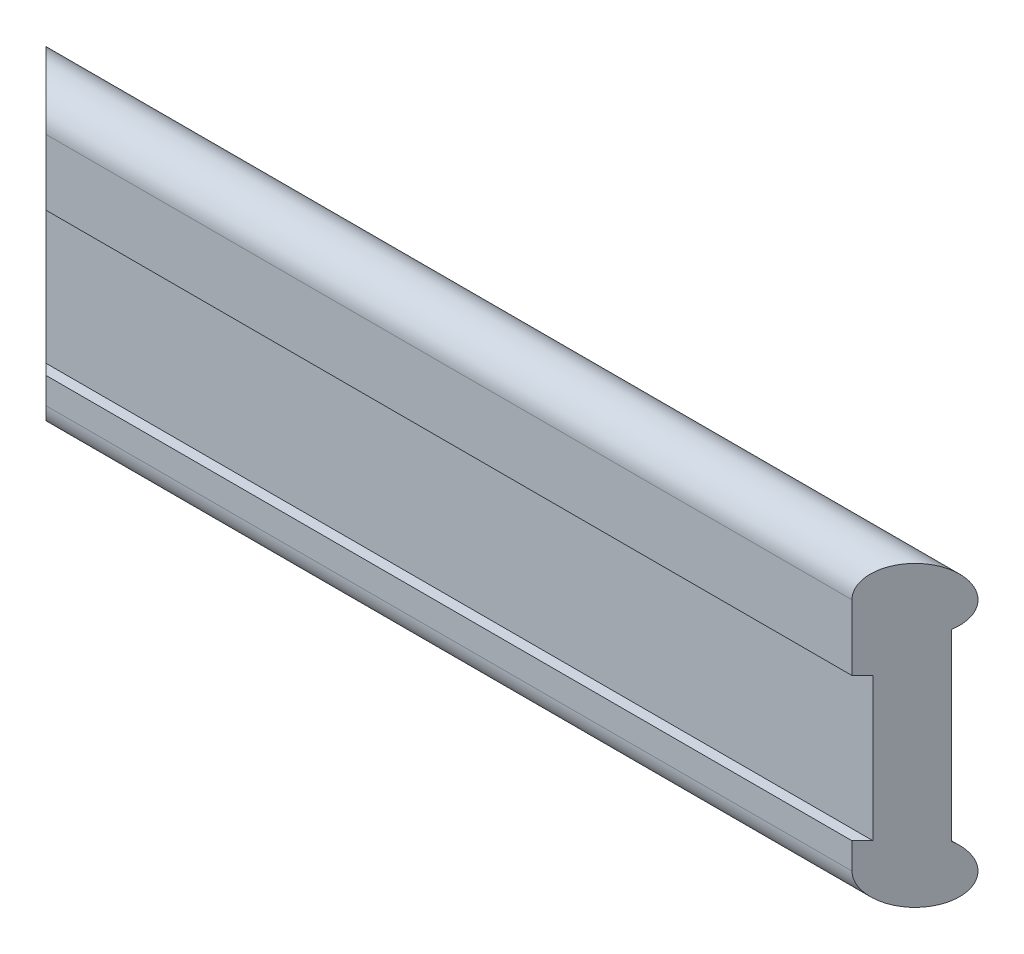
ISO-10303-21;
HEADER;
FILE_DESCRIPTION(('STEP AP214'),'2;1');
FILE_NAME('part.step','',(''),(''),'','','');
FILE_SCHEMA(('AUTOMOTIVE_DESIGN { 1 0 10303 214 1 1 1 1 }'));
ENDSEC;
DATA;
#1=APPLICATION_CONTEXT('core data for automotive mechanical design processes');
#2=APPLICATION_PROTOCOL_DEFINITION('international standard','automotive_design',2000,#1);
#3=PRODUCT_CONTEXT('',#1,'mechanical');
#4=PRODUCT('Part','Part','',(#3));
#5=PRODUCT_RELATED_PRODUCT_CATEGORY('part','',(#4));
#6=PRODUCT_DEFINITION_FORMATION('','',#4);
#7=PRODUCT_DEFINITION_CONTEXT('part definition',#1,'design');
#8=PRODUCT_DEFINITION('design','',#6,#7);
#9=PRODUCT_DEFINITION_SHAPE('','',#8);
#10=(LENGTH_UNIT() NAMED_UNIT(*) SI_UNIT(.MILLI.,.METRE.));
#11=(NAMED_UNIT(*) PLANE_ANGLE_UNIT() SI_UNIT($,.RADIAN.));
#12=(NAMED_UNIT(*) SI_UNIT($,.STERADIAN.) SOLID_ANGLE_UNIT());
#13=UNCERTAINTY_MEASURE_WITH_UNIT(LENGTH_MEASURE(1.E-05),#10,'distance_accuracy_value','');
#14=(GEOMETRIC_REPRESENTATION_CONTEXT(3) GLOBAL_UNCERTAINTY_ASSIGNED_CONTEXT((#13)) GLOBAL_UNIT_ASSIGNED_CONTEXT((#10,
#11,#12)) REPRESENTATION_CONTEXT('',''));
#15=CARTESIAN_POINT('',(0.,0.,0.));
#16=DIRECTION('',(0.,0.,1.));
#17=DIRECTION('',(1.,0.,0.));
#18=AXIS2_PLACEMENT_3D('',#15,#16,#17);
#19=CARTESIAN_POINT('',(0.,0.,15.));
#20=DIRECTION('',(0.,0.,-1.));
#21=DIRECTION('',(-1.,0.,0.));
#22=AXIS2_PLACEMENT_3D('',#19,#20,#21);
#23=PLANE('',#22);
#24=DIRECTION('',(-1.,0.,0.));
#25=VECTOR('',#24,1.);
#26=CARTESIAN_POINT('',(-177.5,27.25,15.));
#27=LINE('',#26,#25);
#28=CARTESIAN_POINT('',(157.5,27.25,15.));
#29=VERTEX_POINT('',#28);
#30=CARTESIAN_POINT('',(-157.5,27.25,15.));
#31=VERTEX_POINT('',#30);
#32=EDGE_CURVE('E37',#29,#31,#27,.T.);
#33=ORIENTED_EDGE('',*,*,#32,.T.);
#34=DIRECTION('',(0.,-1.,0.));
#35=VECTOR('',#34,1.);
#36=CARTESIAN_POINT('',(-157.5,0.,15.));
#37=LINE('',#36,#35);
#38=CARTESIAN_POINT('',(-157.5,-27.25,15.));
#39=VERTEX_POINT('',#38);
#40=EDGE_CURVE('E57',#31,#39,#37,.T.);
#41=ORIENTED_EDGE('',*,*,#40,.T.);
#42=DIRECTION('',(1.,0.,0.));
#43=VECTOR('',#42,1.);
#44=CARTESIAN_POINT('',(-177.5,-27.25,15.));
#45=LINE('',#44,#43);
#46=CARTESIAN_POINT('',(157.5,-27.25,15.));
#47=VERTEX_POINT('',#46);
#48=EDGE_CURVE('E106',#39,#47,#45,.T.);
#49=ORIENTED_EDGE('',*,*,#48,.T.);
#50=DIRECTION('',(0.,1.,0.));
#51=VECTOR('',#50,1.);
#52=CARTESIAN_POINT('',(157.5,0.,15.));
#53=LINE('',#52,#51);
#54=EDGE_CURVE('E146',#47,#29,#53,.T.);
#55=ORIENTED_EDGE('',*,*,#54,.T.);
#56=EDGE_LOOP('',(#33,#41,#49,#55));
#57=FACE_BOUND('',#56,.T.);
#58=ADVANCED_FACE('F33',(#57),#23,.F.);
#59=CARTESIAN_POINT('',(0.,0.,0.));
#60=DIRECTION('',(0.,0.,-1.));
#61=DIRECTION('',(-1.,0.,0.));
#62=AXIS2_PLACEMENT_3D('',#59,#60,#61);
#63=PLANE('',#62);
#64=DIRECTION('',(0.,-1.,0.));
#65=VECTOR('',#64,1.);
#66=CARTESIAN_POINT('',(-172.5,0.,0.));
#67=LINE('',#66,#65);
#68=CARTESIAN_POINT('',(-172.5,42.503205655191,0.));
#69=VERTEX_POINT('',#68);
#70=CARTESIAN_POINT('',(-172.5,-27.503205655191,0.));
#71=VERTEX_POINT('',#70);
#72=EDGE_CURVE('E159',#69,#71,#67,.T.);
#73=ORIENTED_EDGE('',*,*,#72,.F.);
#74=DIRECTION('',(-1.,0.,0.));
#75=VECTOR('',#74,1.);
#76=CARTESIAN_POINT('',(221.6021541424,42.503205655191,0.));
#77=LINE('',#76,#75);
#78=CARTESIAN_POINT('',(172.5,42.503205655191,0.));
#79=VERTEX_POINT('',#78);
#80=EDGE_CURVE('E130',#79,#69,#77,.T.);
#81=ORIENTED_EDGE('',*,*,#80,.F.);
#82=DIRECTION('',(0.,1.,0.));
#83=VECTOR('',#82,1.);
#84=CARTESIAN_POINT('',(172.5,0.,0.));
#85=LINE('',#84,#83);
#86=CARTESIAN_POINT('',(172.5,-27.503205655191,0.));
#87=VERTEX_POINT('',#86);
#88=EDGE_CURVE('E166',#87,#79,#85,.T.);
#89=ORIENTED_EDGE('',*,*,#88,.F.);
#90=DIRECTION('',(-1.,0.,0.));
#91=VECTOR('',#90,1.);
#92=CARTESIAN_POINT('',(221.6021541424,-27.503205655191,0.));
#93=LINE('',#92,#91);
#94=EDGE_CURVE('E102',#87,#71,#93,.T.);
#95=ORIENTED_EDGE('',*,*,#94,.T.);
#96=EDGE_LOOP('',(#73,#81,#89,#95));
#97=FACE_BOUND('',#96,.T.);
#98=ADVANCED_FACE('F35',(#97),#63,.T.);
#99=CARTESIAN_POINT('',(221.6021541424,27.25,15.));
#100=DIRECTION('',(0.,-1.,0.));
#101=DIRECTION('',(0.,0.,-1.));
#102=AXIS2_PLACEMENT_3D('',#99,#100,#101);
#103=PLANE('',#102);
#104=DIRECTION('',(0.707106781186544,0.,0.707106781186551));
#105=VECTOR('',#104,1.);
#106=CARTESIAN_POINT('',(32.051077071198,27.25,204.5510770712));
#107=LINE('',#106,#105);
#108=CARTESIAN_POINT('',(-153.5,27.25,19.));
#109=VERTEX_POINT('',#108);
#110=EDGE_CURVE('E126',#31,#109,#107,.T.);
#111=ORIENTED_EDGE('',*,*,#110,.F.);
#112=ORIENTED_EDGE('',*,*,#32,.F.);
#113=DIRECTION('',(0.707106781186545,0.,-0.70710678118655));
#114=VECTOR('',#113,1.);
#115=CARTESIAN_POINT('',(189.5510770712,27.25,-17.0510770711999));
#116=LINE('',#115,#114);
#117=CARTESIAN_POINT('',(153.5,27.25,18.9999999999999));
#118=VERTEX_POINT('',#117);
#119=EDGE_CURVE('E150',#118,#29,#116,.T.);
#120=ORIENTED_EDGE('',*,*,#119,.F.);
#121=DIRECTION('',(-1.,0.,0.));
#122=VECTOR('',#121,1.);
#123=CARTESIAN_POINT('',(221.6021541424,27.25,19.));
#124=LINE('',#123,#122);
#125=EDGE_CURVE('E124',#118,#109,#124,.T.);
#126=ORIENTED_EDGE('',*,*,#125,.T.);
#127=EDGE_LOOP('',(#111,#112,#120,#126));
#128=FACE_BOUND('',#127,.T.);
#129=ADVANCED_FACE('F149',(#128),#103,.T.);
#130=CARTESIAN_POINT('',(221.6021541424,52.25,7.));
#131=DIRECTION('',(-1.,0.,0.));
#132=DIRECTION('',(0.,0.,1.));
#133=AXIS2_PLACEMENT_3D('',#130,#131,#132);
#134=CYLINDRICAL_SURFACE('',#133,12.);
#135=CARTESIAN_POINT('',(-165.5,52.25,7.));
#136=DIRECTION('',(0.707106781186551,0.,-0.707106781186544));
#137=DIRECTION('',(-0.707106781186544,0.,-0.707106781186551));
#138=AXIS2_PLACEMENT_3D('',#135,#136,#137);
#139=ELLIPSE('',#138,16.9705627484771,12.);
#140=CARTESIAN_POINT('',(-153.5,52.25,19.));
#141=VERTEX_POINT('',#140);
#142=EDGE_CURVE('E157',#141,#69,#139,.F.);
#143=ORIENTED_EDGE('',*,*,#142,.F.);
#144=DIRECTION('',(-1.,0.,0.));
#145=VECTOR('',#144,1.);
#146=CARTESIAN_POINT('',(221.6021541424,52.25,19.));
#147=LINE('',#146,#145);
#148=CARTESIAN_POINT('',(153.5,52.25,18.9999999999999));
#149=VERTEX_POINT('',#148);
#150=EDGE_CURVE('E133',#149,#141,#147,.T.);
#151=ORIENTED_EDGE('',*,*,#150,.F.);
#152=CARTESIAN_POINT('',(165.5,52.25,7.));
#153=DIRECTION('',(-0.70710678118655,0.,-0.707106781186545));
#154=DIRECTION('',(-0.707106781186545,0.,0.70710678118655));
#155=AXIS2_PLACEMENT_3D('',#152,#153,#154);
#156=ELLIPSE('',#155,16.9705627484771,12.);
#157=EDGE_CURVE('E164',#79,#149,#156,.F.);
#158=ORIENTED_EDGE('',*,*,#157,.F.);
#159=ORIENTED_EDGE('',*,*,#80,.T.);
#160=EDGE_LOOP('',(#143,#151,#158,#159));
#161=FACE_BOUND('',#160,.T.);
#162=ADVANCED_FACE('F182',(#161),#134,.T.);
#163=CARTESIAN_POINT('',(221.6021541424,27.25,19.));
#164=DIRECTION('',(0.,0.,1.));
#165=DIRECTION('',(0.,-1.,0.));
#166=AXIS2_PLACEMENT_3D('',#163,#164,#165);
#167=PLANE('',#166);
#168=DIRECTION('',(0.,1.,0.));
#169=VECTOR('',#168,1.);
#170=CARTESIAN_POINT('',(-153.5,-49.25,19.));
#171=LINE('',#170,#169);
#172=EDGE_CURVE('E116',#109,#141,#171,.T.);
#173=ORIENTED_EDGE('',*,*,#172,.F.);
#174=ORIENTED_EDGE('',*,*,#125,.F.);
#175=DIRECTION('',(0.,1.,0.));
#176=VECTOR('',#175,1.);
#177=CARTESIAN_POINT('',(153.5,-49.25,18.9999999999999));
#178=LINE('',#177,#176);
#179=EDGE_CURVE('E117',#118,#149,#178,.T.);
#180=ORIENTED_EDGE('',*,*,#179,.T.);
#181=ORIENTED_EDGE('',*,*,#150,.T.);
#182=EDGE_LOOP('',(#173,#174,#180,#181));
#183=FACE_BOUND('',#182,.T.);
#184=ADVANCED_FACE('F175',(#183),#167,.T.);
#185=CARTESIAN_POINT('',(221.6021541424,-27.25,0.));
#186=DIRECTION('',(0.,1.,0.));
#187=DIRECTION('',(0.,0.,1.));
#188=AXIS2_PLACEMENT_3D('',#185,#186,#187);
#189=PLANE('',#188);
#190=DIRECTION('',(-0.707106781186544,0.,-0.707106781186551));
#191=VECTOR('',#190,1.);
#192=CARTESIAN_POINT('',(24.5510770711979,-27.25,197.0510770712));
#193=LINE('',#192,#191);
#194=CARTESIAN_POINT('',(-153.5,-27.25,19.));
#195=VERTEX_POINT('',#194);
#196=EDGE_CURVE('E153',#195,#39,#193,.T.);
#197=ORIENTED_EDGE('',*,*,#196,.F.);
#198=DIRECTION('',(-1.,0.,0.));
#199=VECTOR('',#198,1.);
#200=CARTESIAN_POINT('',(221.6021541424,-27.25,19.));
#201=LINE('',#200,#199);
#202=CARTESIAN_POINT('',(153.5,-27.25,18.9999999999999));
#203=VERTEX_POINT('',#202);
#204=EDGE_CURVE('E122',#203,#195,#201,.T.);
#205=ORIENTED_EDGE('',*,*,#204,.F.);
#206=DIRECTION('',(-0.707106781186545,0.,0.70710678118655));
#207=VECTOR('',#206,1.);
#208=CARTESIAN_POINT('',(197.0510770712,-27.25,-24.5510770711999));
#209=LINE('',#208,#207);
#210=EDGE_CURVE('E112',#47,#203,#209,.T.);
#211=ORIENTED_EDGE('',*,*,#210,.F.);
#212=ORIENTED_EDGE('',*,*,#48,.F.);
#213=EDGE_LOOP('',(#197,#205,#211,#212));
#214=FACE_BOUND('',#213,.T.);
#215=ADVANCED_FACE('F173',(#214),#189,.T.);
#216=CARTESIAN_POINT('',(221.6021541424,-27.25,19.));
#217=DIRECTION('',(0.,0.,1.));
#218=DIRECTION('',(0.,-1.,0.));
#219=AXIS2_PLACEMENT_3D('',#216,#217,#218);
#220=PLANE('',#219);
#221=CARTESIAN_POINT('',(-153.5,-37.25,19.));
#222=VERTEX_POINT('',#221);
#223=EDGE_CURVE('E121',#222,#195,#171,.T.);
#224=ORIENTED_EDGE('',*,*,#223,.F.);
#225=DIRECTION('',(-1.,0.,0.));
#226=VECTOR('',#225,1.);
#227=CARTESIAN_POINT('',(221.6021541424,-37.25,19.));
#228=LINE('',#227,#226);
#229=CARTESIAN_POINT('',(153.5,-37.25,19.));
#230=VERTEX_POINT('',#229);
#231=EDGE_CURVE('E100',#230,#222,#228,.T.);
#232=ORIENTED_EDGE('',*,*,#231,.F.);
#233=EDGE_CURVE('E109',#230,#203,#178,.T.);
#234=ORIENTED_EDGE('',*,*,#233,.T.);
#235=ORIENTED_EDGE('',*,*,#204,.T.);
#236=EDGE_LOOP('',(#224,#232,#234,#235));
#237=FACE_BOUND('',#236,.T.);
#238=ADVANCED_FACE('F120',(#237),#220,.T.);
#239=CARTESIAN_POINT('',(221.6021541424,-37.25,7.));
#240=DIRECTION('',(-1.,0.,0.));
#241=DIRECTION('',(0.,0.,1.));
#242=AXIS2_PLACEMENT_3D('',#239,#240,#241);
#243=CYLINDRICAL_SURFACE('',#242,12.);
#244=CARTESIAN_POINT('',(-165.5,-37.25,7.));
#245=DIRECTION('',(0.707106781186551,0.,-0.707106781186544));
#246=DIRECTION('',(-0.707106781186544,0.,-0.707106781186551));
#247=AXIS2_PLACEMENT_3D('',#244,#245,#246);
#248=ELLIPSE('',#247,16.9705627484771,12.);
#249=EDGE_CURVE('E11',#71,#222,#248,.F.);
#250=ORIENTED_EDGE('',*,*,#249,.F.);
#251=ORIENTED_EDGE('',*,*,#94,.F.);
#252=CARTESIAN_POINT('',(165.5,-37.25,7.));
#253=DIRECTION('',(-0.70710678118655,0.,-0.707106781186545));
#254=DIRECTION('',(-0.707106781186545,0.,0.70710678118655));
#255=AXIS2_PLACEMENT_3D('',#252,#253,#254);
#256=ELLIPSE('',#255,16.9705627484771,12.);
#257=EDGE_CURVE('E43',#230,#87,#256,.F.);
#258=ORIENTED_EDGE('',*,*,#257,.F.);
#259=ORIENTED_EDGE('',*,*,#231,.T.);
#260=EDGE_LOOP('',(#250,#251,#258,#259));
#261=FACE_BOUND('',#260,.T.);
#262=ADVANCED_FACE('F98',(#261),#243,.T.);
#263=CARTESIAN_POINT('',(153.5,-49.25,18.9999999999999));
#264=DIRECTION('',(-0.70710678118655,0.,-0.707106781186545));
#265=DIRECTION('',(-0.707106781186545,0.,0.70710678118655));
#266=AXIS2_PLACEMENT_3D('',#263,#264,#265);
#267=PLANE('',#266);
#268=ORIENTED_EDGE('',*,*,#119,.T.);
#269=ORIENTED_EDGE('',*,*,#54,.F.);
#270=ORIENTED_EDGE('',*,*,#210,.T.);
#271=ORIENTED_EDGE('',*,*,#233,.F.);
#272=ORIENTED_EDGE('',*,*,#257,.T.);
#273=ORIENTED_EDGE('',*,*,#88,.T.);
#274=ORIENTED_EDGE('',*,*,#157,.T.);
#275=ORIENTED_EDGE('',*,*,#179,.F.);
#276=EDGE_LOOP('',(#268,#269,#270,#271,#272,#273,#274,#275));
#277=FACE_BOUND('',#276,.T.);
#278=ADVANCED_FACE('F110',(#277),#267,.F.);
#279=CARTESIAN_POINT('',(-177.5,-49.25,-5.));
#280=DIRECTION('',(0.707106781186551,0.,-0.707106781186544));
#281=DIRECTION('',(-0.707106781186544,0.,-0.707106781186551));
#282=AXIS2_PLACEMENT_3D('',#279,#280,#281);
#283=PLANE('',#282);
#284=ORIENTED_EDGE('',*,*,#110,.T.);
#285=ORIENTED_EDGE('',*,*,#172,.T.);
#286=ORIENTED_EDGE('',*,*,#142,.T.);
#287=ORIENTED_EDGE('',*,*,#72,.T.);
#288=ORIENTED_EDGE('',*,*,#249,.T.);
#289=ORIENTED_EDGE('',*,*,#223,.T.);
#290=ORIENTED_EDGE('',*,*,#196,.T.);
#291=ORIENTED_EDGE('',*,*,#40,.F.);
#292=EDGE_LOOP('',(#284,#285,#286,#287,#288,#289,#290,#291));
#293=FACE_BOUND('',#292,.T.);
#294=ADVANCED_FACE('F171',(#293),#283,.F.);
#295=CLOSED_SHELL('',(#58,#98,#129,#162,#184,#215,#238,#262,#278,#294));
#296=MANIFOLD_SOLID_BREP('B2',#295);
#297=ADVANCED_BREP_SHAPE_REPRESENTATION('',(#18,#296),#14);
#298=SHAPE_DEFINITION_REPRESENTATION(#9,#297);
ENDSEC;
END-ISO-10303-21;
